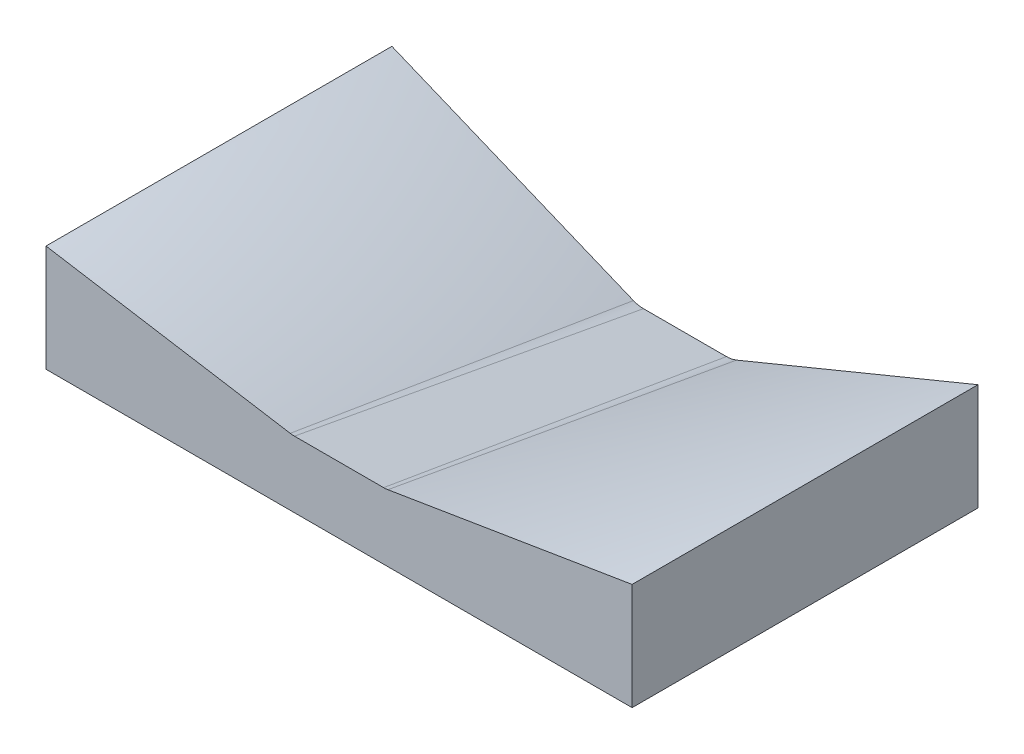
ISO-10303-21;
HEADER;
FILE_DESCRIPTION(('STEP AP214'),'2;1');
FILE_NAME('part.step','',(''),(''),'','','');
FILE_SCHEMA(('AUTOMOTIVE_DESIGN { 1 0 10303 214 1 1 1 1 }'));
ENDSEC;
DATA;
#1=APPLICATION_CONTEXT('core data for automotive mechanical design processes');
#2=APPLICATION_PROTOCOL_DEFINITION('international standard','automotive_design',2000,#1);
#3=PRODUCT_CONTEXT('',#1,'mechanical');
#4=PRODUCT('Part','Part','',(#3));
#5=PRODUCT_RELATED_PRODUCT_CATEGORY('part','',(#4));
#6=PRODUCT_DEFINITION_FORMATION('','',#4);
#7=PRODUCT_DEFINITION_CONTEXT('part definition',#1,'design');
#8=PRODUCT_DEFINITION('design','',#6,#7);
#9=PRODUCT_DEFINITION_SHAPE('','',#8);
#10=(LENGTH_UNIT() NAMED_UNIT(*) SI_UNIT(.MILLI.,.METRE.));
#11=(NAMED_UNIT(*) PLANE_ANGLE_UNIT() SI_UNIT($,.RADIAN.));
#12=(NAMED_UNIT(*) SI_UNIT($,.STERADIAN.) SOLID_ANGLE_UNIT());
#13=UNCERTAINTY_MEASURE_WITH_UNIT(LENGTH_MEASURE(1.E-05),#10,'distance_accuracy_value','');
#14=(GEOMETRIC_REPRESENTATION_CONTEXT(3) GLOBAL_UNCERTAINTY_ASSIGNED_CONTEXT((#13)) GLOBAL_UNIT_ASSIGNED_CONTEXT((#10,
#11,#12)) REPRESENTATION_CONTEXT('',''));
#15=CARTESIAN_POINT('',(0.,0.,0.));
#16=DIRECTION('',(0.,0.,1.));
#17=DIRECTION('',(1.,0.,0.));
#18=AXIS2_PLACEMENT_3D('',#15,#16,#17);
#19=CARTESIAN_POINT('',(17.5,24.8519766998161,0.));
#20=DIRECTION('',(0.,0.,-1.));
#21=DIRECTION('',(0.,1.,0.));
#22=AXIS2_PLACEMENT_3D('',#19,#20,#21);
#23=PLANE('',#22);
#24=DIRECTION('',(-0.986798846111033,-0.161950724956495,0.));
#25=VECTOR('',#24,1.);
#26=CARTESIAN_POINT('',(63.65,32.4259883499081,0.));
#27=LINE('',#26,#25);
#28=CARTESIAN_POINT('',(109.8,40.,0.));
#29=VERTEX_POINT('',#28);
#30=CARTESIAN_POINT('',(18.2930915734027,24.9821367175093,0.));
#31=VERTEX_POINT('',#30);
#32=EDGE_CURVE('E238',#29,#31,#27,.T.);
#33=ORIENTED_EDGE('',*,*,#32,.T.);
#34=CARTESIAN_POINT('',(19.5300489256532,-3.28344653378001,-165.084261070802));
#35=CARTESIAN_POINT('',(17.5014750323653,-4.22467563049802,-164.901889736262));
#36=CARTESIAN_POINT('',(15.2578252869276,-4.22157234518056,-164.88429013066));
#37=CARTESIAN_POINT('',(19.4954893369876,-2.28018789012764,-159.170011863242));
#38=CARTESIAN_POINT('',(17.501428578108,-3.18399226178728,-158.999881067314));
#39=CARTESIAN_POINT('',(15.3056121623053,-3.1799993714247,-158.977236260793));
#40=CARTESIAN_POINT('',(19.4598105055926,-1.27619849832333,-153.255865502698));
#41=CARTESIAN_POINT('',(17.5013818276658,-2.14239247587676,-153.092675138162));
#42=CARTESIAN_POINT('',(15.3538529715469,-2.13842703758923,-153.070186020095));
#43=CARTESIAN_POINT('',(19.3862143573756,0.733241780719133,-141.427778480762));
#44=CARTESIAN_POINT('',(17.5012878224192,-0.0592757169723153,-141.278732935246));
#45=CARTESIAN_POINT('',(15.4512424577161,-0.0552836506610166,-141.256092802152));
#46=CARTESIAN_POINT('',(19.3482970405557,1.73869266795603,-135.513837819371));
#47=CARTESIAN_POINT('',(17.5012405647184,0.982327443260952,-135.371507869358));
#48=CARTESIAN_POINT('',(15.5003911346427,0.986287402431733,-135.349049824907));
#49=CARTESIAN_POINT('',(19.3092604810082,2.7448743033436,-129.600000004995));
#50=CARTESIAN_POINT('',(17.5011930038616,2.02505651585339,-129.457897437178));
#51=CARTESIAN_POINT('',(15.5499937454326,2.02785781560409,-129.44201047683));
#52=CARTESIAN_POINT('',(19.277105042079,3.57416023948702,-124.726251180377));
#53=CARTESIAN_POINT('',(17.5011540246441,2.88280156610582,-124.593383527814));
#54=CARTESIAN_POINT('',(15.5908608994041,2.88624529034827,-124.573853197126));
#55=CARTESIAN_POINT('',(19.2441837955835,4.40402026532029,-119.852585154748));
#56=CARTESIAN_POINT('',(17.5011149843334,3.7412756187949,-119.724735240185));
#57=CARTESIAN_POINT('',(15.6320281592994,3.7446323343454,-119.705698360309));
#58=CARTESIAN_POINT('',(19.095169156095,8.08048504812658,-98.2782224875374));
#59=CARTESIAN_POINT('',(17.5009431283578,7.53472803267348,-98.2109975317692));
#60=CARTESIAN_POINT('',(15.8155322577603,7.54454484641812,-98.1553236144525));
#61=CARTESIAN_POINT('',(18.9711191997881,10.9339675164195,-81.5785438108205));
#62=CARTESIAN_POINT('',(17.5008115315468,10.4777959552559,-81.5200299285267));
#63=CARTESIAN_POINT('',(15.9609379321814,10.4860658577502,-81.473128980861));
#64=CARTESIAN_POINT('',(18.7076515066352,16.6612889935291,-48.1823756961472));
#65=CARTESIAN_POINT('',(17.50056598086,16.3612310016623,-48.1534117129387));
#66=CARTESIAN_POINT('',(16.2572955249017,16.3690991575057,-48.1087891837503));
#67=CARTESIAN_POINT('',(18.5682337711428,19.5351280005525,-31.48588625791));
#68=CARTESIAN_POINT('',(17.5004518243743,19.3047584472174,-31.4598380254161));
#69=CARTESIAN_POINT('',(16.4082474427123,19.31061144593,-31.4266440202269));
#70=CARTESIAN_POINT('',(18.3802538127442,23.273892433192,-9.86077718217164));
#71=CARTESIAN_POINT('',(17.5003246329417,23.1191037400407,-9.82761091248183));
#72=CARTESIAN_POINT('',(16.6063323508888,23.1208877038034,-9.81749355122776));
#73=CARTESIAN_POINT('',(18.3368958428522,24.1274415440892,-4.93029376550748));
#74=CARTESIAN_POINT('',(17.5002970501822,23.9879795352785,-4.89997141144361));
#75=CARTESIAN_POINT('',(16.6516686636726,23.9896544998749,-4.89047221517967));
#76=CARTESIAN_POINT('',(18.293091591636,24.9821367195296,-5.5612234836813E-09));
#77=CARTESIAN_POINT('',(17.500271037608,24.8571531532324,0.0293571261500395));
#78=CARTESIAN_POINT('',(16.6971559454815,24.8584210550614,0.0365477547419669));
#79=CARTESIAN_POINT('',(18.2663480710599,25.5040611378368,3.01074410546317));
#80=CARTESIAN_POINT('',(17.5002551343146,25.3876000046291,3.03767071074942));
#81=CARTESIAN_POINT('',(16.7249319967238,25.3889438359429,3.04529195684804));
#82=CARTESIAN_POINT('',(18.2394428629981,26.0264089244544,6.02141802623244));
#83=CARTESIAN_POINT('',(17.5002398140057,25.9181772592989,6.04672384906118));
#84=CARTESIAN_POINT('',(16.752763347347,25.9194665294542,6.0540356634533));
#85=CARTESIAN_POINT('',(18.1853404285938,27.0719696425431,12.0426214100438));
#86=CARTESIAN_POINT('',(17.500210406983,26.9793084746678,12.0646980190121));
#87=CARTESIAN_POINT('',(16.8085254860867,26.9805117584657,12.0715221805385));
#88=CARTESIAN_POINT('',(18.1581432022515,27.5951825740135,15.053150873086));
#89=CARTESIAN_POINT('',(17.5001963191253,27.5098859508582,15.073752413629));
#90=CARTESIAN_POINT('',(16.8364562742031,27.5110342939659,15.0802649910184));
#91=CARTESIAN_POINT('',(18.1034880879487,28.6424919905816,21.0740612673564));
#92=CARTESIAN_POINT('',(17.5001694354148,28.571017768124,21.0917299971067));
#93=CARTESIAN_POINT('',(16.8924061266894,28.572079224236,21.0977498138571));
#94=CARTESIAN_POINT('',(18.0760301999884,29.1665884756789,24.0844421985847));
#95=CARTESIAN_POINT('',(17.5001566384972,29.101596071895,24.1007890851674));
#96=CARTESIAN_POINT('',(16.9204251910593,29.1026016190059,24.1064918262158));
#97=CARTESIAN_POINT('',(18.0208868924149,30.2156803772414,30.1050519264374));
#98=CARTESIAN_POINT('',(17.5001323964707,30.1627285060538,30.1187701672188));
#99=CARTESIAN_POINT('',(16.9765400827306,30.163646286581,30.1239751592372));
#100=CARTESIAN_POINT('',(17.9932014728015,30.7406757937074,33.1152807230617));
#101=CARTESIAN_POINT('',(17.5001209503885,30.6933069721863,33.127830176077));
#102=CARTESIAN_POINT('',(17.004635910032,30.6941685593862,33.1327164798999));
#103=CARTESIAN_POINT('',(17.9654188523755,31.2661283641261,36.1254316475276));
#104=CARTESIAN_POINT('',(17.5001102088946,31.2239436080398,36.137220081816));
#105=CARTESIAN_POINT('',(17.0327643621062,31.2246907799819,36.1414575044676));
#106=(BOUNDED_SURFACE() B_SPLINE_SURFACE(3,2,((#34,#35,#36),(#37,#38,#39),(#40,#41,#42),(#43,
#44,#45),(#46,#47,#48),(#49,#50,#51),(#52,#53,#54),(#55,#56,#57),(#58,#59,#60),(#61,#62,#63),
(#64,#65,#66),(#67,#68,#69),(#70,#71,#72),(#73,#74,#75),(#76,#77,#78),(#79,#80,#81),(#82,#83,
#84),(#85,#86,#87),(#88,#89,#90),(#91,#92,#93),(#94,#95,#96),(#97,#98,#99),(#100,#101,#102),
(#103,#104,#105)),.UNSPECIFIED.,.F.,.F.,.F.) B_SPLINE_SURFACE_WITH_KNOTS((4,2,3,2,2,2,3,2,2,2,
4),(3,3),(0.,17.9951099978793,35.9902199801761,50.8204961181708,101.641000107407,
152.461499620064,167.471201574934,176.63705714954,185.802912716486,194.968768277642,
204.134623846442),(0.,1.),
.UNSPECIFIED.) GEOMETRIC_REPRESENTATION_ITEM() RATIONAL_B_SPLINE_SURFACE(((1.,0.975740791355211,
1.),(1.,0.976739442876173,1.),(1.,0.977717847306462,1.),(1.,0.979634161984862,1.),(1.,
0.980572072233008,1.),(1.,0.981489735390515,1.),(1.,0.982244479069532,1.),(1.,0.982983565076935,
1.),(1.,0.986179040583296,1.),(1.,0.988450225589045,1.),(1.,0.992460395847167,1.),(1.,
0.994199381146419,1.),(1.,0.996037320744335,1.),(1.,0.99642845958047,1.),(1.,0.996790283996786,
1.),(1.,0.997011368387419,1.),(1.,0.997221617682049,1.),(1.,0.997620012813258,1.),(1.,
0.997808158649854,1.),(1.,0.998161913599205,1.),(1.,0.998327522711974,1.),(1.,0.998635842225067,
1.),(1.,0.998778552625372,1.),(1.,0.998909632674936,1.))) REPRESENTATION_ITEM('') SURFACE());
#107=CARTESIAN_POINT('',(18.2930915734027,24.9821367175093,0.));
#108=CARTESIAN_POINT('',(18.0288115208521,24.9387919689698,0.));
#109=CARTESIAN_POINT('',(17.7636487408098,24.9062729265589,0.));
#110=CARTESIAN_POINT('',(17.2315577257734,24.862886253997,0.));
#111=CARTESIAN_POINT('',(16.9646294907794,24.8520186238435,0.));
#112=CARTESIAN_POINT('',(16.6968185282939,24.8519766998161,0.));
#113=B_SPLINE_CURVE_WITH_KNOTS('',3,(#107,#108,#109,#110,#111,#112),.UNSPECIFIED.,.F.,.F.,(4,2,
4),(0.,0.801448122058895,1.60289624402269),.UNSPECIFIED.);
#114=CARTESIAN_POINT('',(16.6968185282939,24.8519766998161,0.));
#115=VERTEX_POINT('',#114);
#116=EDGE_CURVE('E344',#31,#115,#113,.T.);
#117=ORIENTED_EDGE('',*,*,#116,.T.);
#118=DIRECTION('',(-1.,0.,0.));
#119=VECTOR('',#118,1.);
#120=CARTESIAN_POINT('',(17.5,24.8519766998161,0.));
#121=LINE('',#120,#119);
#122=CARTESIAN_POINT('',(-16.696818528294,24.8519766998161,0.));
#123=VERTEX_POINT('',#122);
#124=EDGE_CURVE('E251',#115,#123,#121,.T.);
#125=ORIENTED_EDGE('',*,*,#124,.T.);
#126=CARTESIAN_POINT('',(-15.2578252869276,-4.22157234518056,-164.88429013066));
#127=CARTESIAN_POINT('',(-17.5014750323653,-4.22467563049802,-164.901889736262));
#128=CARTESIAN_POINT('',(-19.5300489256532,-3.28344653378,-165.084261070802));
#129=CARTESIAN_POINT('',(-15.3056121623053,-3.1799993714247,-158.977236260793));
#130=CARTESIAN_POINT('',(-17.501428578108,-3.18399226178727,-158.999881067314));
#131=CARTESIAN_POINT('',(-19.4954893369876,-2.28018789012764,-159.170011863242));
#132=CARTESIAN_POINT('',(-15.3538529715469,-2.13842703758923,-153.070186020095));
#133=CARTESIAN_POINT('',(-17.5013818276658,-2.14239247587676,-153.092675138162));
#134=CARTESIAN_POINT('',(-19.4598105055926,-1.27619849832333,-153.255865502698));
#135=CARTESIAN_POINT('',(-15.4512424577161,-0.0552836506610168,-141.256092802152));
#136=CARTESIAN_POINT('',(-17.5012878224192,-0.0592757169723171,-141.278732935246));
#137=CARTESIAN_POINT('',(-19.3862143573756,0.733241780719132,-141.427778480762));
#138=CARTESIAN_POINT('',(-15.5003911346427,0.986287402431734,-135.349049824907));
#139=CARTESIAN_POINT('',(-17.5012405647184,0.98232744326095,-135.371507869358));
#140=CARTESIAN_POINT('',(-19.3482970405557,1.73869266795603,-135.513837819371));
#141=CARTESIAN_POINT('',(-15.5499937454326,2.02785781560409,-129.44201047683));
#142=CARTESIAN_POINT('',(-17.5011930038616,2.02505651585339,-129.457897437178));
#143=CARTESIAN_POINT('',(-19.3092604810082,2.7448743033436,-129.600000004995));
#144=CARTESIAN_POINT('',(-15.5908608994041,2.88624529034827,-124.573853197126));
#145=CARTESIAN_POINT('',(-17.5011540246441,2.88280156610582,-124.593383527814));
#146=CARTESIAN_POINT('',(-19.277105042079,3.57416023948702,-124.726251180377));
#147=CARTESIAN_POINT('',(-15.6320281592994,3.7446323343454,-119.705698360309));
#148=CARTESIAN_POINT('',(-17.5011149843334,3.7412756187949,-119.724735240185));
#149=CARTESIAN_POINT('',(-19.2441837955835,4.40402026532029,-119.852585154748));
#150=CARTESIAN_POINT('',(-15.8155322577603,7.54454484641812,-98.1553236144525));
#151=CARTESIAN_POINT('',(-17.5009431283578,7.53472803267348,-98.2109975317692));
#152=CARTESIAN_POINT('',(-19.095169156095,8.08048504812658,-98.2782224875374));
#153=CARTESIAN_POINT('',(-15.9609379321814,10.4860658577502,-81.473128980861));
#154=CARTESIAN_POINT('',(-17.5008115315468,10.4777959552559,-81.5200299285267));
#155=CARTESIAN_POINT('',(-18.9711191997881,10.9339675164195,-81.5785438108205));
#156=CARTESIAN_POINT('',(-16.2572955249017,16.3690991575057,-48.1087891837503));
#157=CARTESIAN_POINT('',(-17.50056598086,16.3612310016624,-48.1534117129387));
#158=CARTESIAN_POINT('',(-18.7076515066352,16.6612889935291,-48.1823756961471));
#159=CARTESIAN_POINT('',(-16.4082474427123,19.31061144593,-31.4266440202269));
#160=CARTESIAN_POINT('',(-17.5004518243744,19.3047584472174,-31.4598380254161));
#161=CARTESIAN_POINT('',(-18.5682337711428,19.5351280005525,-31.48588625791));
#162=CARTESIAN_POINT('',(-16.6063323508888,23.1208877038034,-9.81749355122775));
#163=CARTESIAN_POINT('',(-17.5003246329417,23.1191037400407,-9.82761091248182));
#164=CARTESIAN_POINT('',(-18.3802538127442,23.273892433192,-9.86077718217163));
#165=CARTESIAN_POINT('',(-16.6516686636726,23.9896544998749,-4.89047221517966));
#166=CARTESIAN_POINT('',(-17.5002970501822,23.9879795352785,-4.8999714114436));
#167=CARTESIAN_POINT('',(-18.3368958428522,24.1274415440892,-4.93029376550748));
#168=CARTESIAN_POINT('',(-16.6971559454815,24.8584210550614,0.0365477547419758));
#169=CARTESIAN_POINT('',(-17.500271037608,24.8571531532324,0.029357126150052));
#170=CARTESIAN_POINT('',(-18.293091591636,24.9821367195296,-5.5612090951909E-09));
#171=CARTESIAN_POINT('',(-16.7249319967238,25.3889438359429,3.04529195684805));
#172=CARTESIAN_POINT('',(-17.5002551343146,25.3876000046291,3.03767071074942));
#173=CARTESIAN_POINT('',(-18.2663480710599,25.5040611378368,3.01074410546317));
#174=CARTESIAN_POINT('',(-16.752763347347,25.9194665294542,6.05403566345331));
#175=CARTESIAN_POINT('',(-17.5002398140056,25.9181772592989,6.04672384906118));
#176=CARTESIAN_POINT('',(-18.2394428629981,26.0264089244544,6.02141802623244));
#177=CARTESIAN_POINT('',(-16.8085254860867,26.9805117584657,12.0715221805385));
#178=CARTESIAN_POINT('',(-17.500210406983,26.9793084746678,12.0646980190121));
#179=CARTESIAN_POINT('',(-18.1853404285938,27.0719696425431,12.0426214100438));
#180=CARTESIAN_POINT('',(-16.8364562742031,27.5110342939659,15.0802649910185));
#181=CARTESIAN_POINT('',(-17.5001963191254,27.5098859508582,15.073752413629));
#182=CARTESIAN_POINT('',(-18.1581432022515,27.5951825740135,15.053150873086));
#183=CARTESIAN_POINT('',(-16.8924061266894,28.572079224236,21.0977498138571));
#184=CARTESIAN_POINT('',(-17.5001694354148,28.571017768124,21.0917299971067));
#185=CARTESIAN_POINT('',(-18.1034880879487,28.6424919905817,21.0740612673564));
#186=CARTESIAN_POINT('',(-16.9204251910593,29.1026016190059,24.1064918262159));
#187=CARTESIAN_POINT('',(-17.5001566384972,29.101596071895,24.1007890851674));
#188=CARTESIAN_POINT('',(-18.0760301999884,29.1665884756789,24.0844421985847));
#189=CARTESIAN_POINT('',(-16.9765400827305,30.163646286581,30.1239751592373));
#190=CARTESIAN_POINT('',(-17.5001323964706,30.1627285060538,30.1187701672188));
#191=CARTESIAN_POINT('',(-18.0208868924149,30.2156803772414,30.1050519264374));
#192=CARTESIAN_POINT('',(-17.004635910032,30.6941685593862,33.1327164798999));
#193=CARTESIAN_POINT('',(-17.5001209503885,30.6933069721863,33.127830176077));
#194=CARTESIAN_POINT('',(-17.9932014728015,30.7406757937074,33.1152807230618));
#195=CARTESIAN_POINT('',(-17.0327643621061,31.2246907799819,36.1414575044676));
#196=CARTESIAN_POINT('',(-17.5001102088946,31.2239436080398,36.1372200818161));
#197=CARTESIAN_POINT('',(-17.9654188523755,31.2661283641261,36.1254316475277));
#198=(BOUNDED_SURFACE() B_SPLINE_SURFACE(3,2,((#126,#127,#128),(#129,#130,#131),(#132,#133,
#134),(#135,#136,#137),(#138,#139,#140),(#141,#142,#143),(#144,#145,#146),(#147,#148,#149),
(#150,#151,#152),(#153,#154,#155),(#156,#157,#158),(#159,#160,#161),(#162,#163,#164),(#165,#166,
#167),(#168,#169,#170),(#171,#172,#173),(#174,#175,#176),(#177,#178,#179),(#180,#181,#182),
(#183,#184,#185),(#186,#187,#188),(#189,#190,#191),(#192,#193,#194),(#195,#196,#197)),
.UNSPECIFIED.,.F.,.F.,.F.) B_SPLINE_SURFACE_WITH_KNOTS((4,2,3,2,2,2,3,2,2,2,4),(3,3),(0.,
17.9951099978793,35.9902199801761,50.8204961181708,101.641000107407,152.461499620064,
167.471201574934,176.63705714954,185.802912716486,194.968768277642,204.134623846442),(0.,1.),
.UNSPECIFIED.) GEOMETRIC_REPRESENTATION_ITEM() RATIONAL_B_SPLINE_SURFACE(((1.,0.975740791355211,
1.),(1.,0.976739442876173,1.),(1.,0.977717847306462,1.),(1.,0.979634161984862,1.),(1.,
0.980572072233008,1.),(1.,0.981489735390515,1.),(1.,0.982244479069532,1.),(1.,0.982983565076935,
1.),(1.,0.986179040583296,1.),(1.,0.988450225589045,1.),(1.,0.992460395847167,1.),(1.,
0.994199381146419,1.),(1.,0.996037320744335,1.),(1.,0.99642845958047,1.),(1.,0.996790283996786,
1.),(1.,0.997011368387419,1.),(1.,0.997221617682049,1.),(1.,0.997620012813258,1.),(1.,
0.997808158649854,1.),(1.,0.998161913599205,1.),(1.,0.998327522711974,1.),(1.,0.998635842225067,
1.),(1.,0.998778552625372,1.),(1.,0.998909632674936,1.))) REPRESENTATION_ITEM('') SURFACE());
#199=CARTESIAN_POINT('',(-16.696818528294,24.8519766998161,0.));
#200=CARTESIAN_POINT('',(-16.964629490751,24.8520186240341,0.));
#201=CARTESIAN_POINT('',(-17.2315577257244,24.8628862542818,0.));
#202=CARTESIAN_POINT('',(-17.763648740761,24.9062729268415,0.));
#203=CARTESIAN_POINT('',(-18.0288115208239,24.9387919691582,0.));
#204=CARTESIAN_POINT('',(-18.2930915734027,24.9821367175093,0.));
#205=B_SPLINE_CURVE_WITH_KNOTS('',3,(#199,#200,#201,#202,#203,#204),.UNSPECIFIED.,.F.,.F.,(4,2,
4),(0.,0.80144812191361,1.60289624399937),.UNSPECIFIED.);
#206=CARTESIAN_POINT('',(-18.2930915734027,24.9821367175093,0.));
#207=VERTEX_POINT('',#206);
#208=EDGE_CURVE('E156',#123,#207,#205,.T.);
#209=ORIENTED_EDGE('',*,*,#208,.T.);
#210=DIRECTION('',(0.986798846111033,-0.161950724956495,0.));
#211=VECTOR('',#210,1.);
#212=CARTESIAN_POINT('',(-63.65,32.4259883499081,0.));
#213=LINE('',#212,#211);
#214=CARTESIAN_POINT('',(-109.8,40.,0.));
#215=VERTEX_POINT('',#214);
#216=EDGE_CURVE('E252',#215,#207,#213,.T.);
#217=ORIENTED_EDGE('',*,*,#216,.F.);
#218=DIRECTION('',(0.,-1.,0.));
#219=VECTOR('',#218,1.);
#220=CARTESIAN_POINT('',(-109.8,20.,0.));
#221=LINE('',#220,#219);
#222=CARTESIAN_POINT('',(-109.8,0.,0.));
#223=VERTEX_POINT('',#222);
#224=EDGE_CURVE('E254',#215,#223,#221,.T.);
#225=ORIENTED_EDGE('',*,*,#224,.T.);
#226=DIRECTION('',(-1.,0.,0.));
#227=VECTOR('',#226,1.);
#228=CARTESIAN_POINT('',(17.5,0.,0.));
#229=LINE('',#228,#227);
#230=CARTESIAN_POINT('',(109.8,0.,0.));
#231=VERTEX_POINT('',#230);
#232=EDGE_CURVE('E267',#231,#223,#229,.T.);
#233=ORIENTED_EDGE('',*,*,#232,.F.);
#234=DIRECTION('',(0.,-1.,0.));
#235=VECTOR('',#234,1.);
#236=CARTESIAN_POINT('',(109.8,20.,0.));
#237=LINE('',#236,#235);
#238=EDGE_CURVE('E243',#29,#231,#237,.T.);
#239=ORIENTED_EDGE('',*,*,#238,.F.);
#240=EDGE_LOOP('',(#33,#117,#125,#209,#217,#225,#233,#239));
#241=FACE_BOUND('',#240,.T.);
#242=ADVANCED_FACE('F143',(#241),#23,.F.);
#243=CARTESIAN_POINT('',(17.5,0.,0.));
#244=DIRECTION('',(0.,1.,0.));
#245=DIRECTION('',(0.,0.,1.));
#246=AXIS2_PLACEMENT_3D('',#243,#244,#245);
#247=PLANE('',#246);
#248=ORIENTED_EDGE('',*,*,#232,.T.);
#249=DIRECTION('',(0.,0.,-1.));
#250=VECTOR('',#249,1.);
#251=CARTESIAN_POINT('',(-109.8,0.,-64.8));
#252=LINE('',#251,#250);
#253=CARTESIAN_POINT('',(-109.8,0.,-129.6));
#254=VERTEX_POINT('',#253);
#255=EDGE_CURVE('E257',#223,#254,#252,.T.);
#256=ORIENTED_EDGE('',*,*,#255,.T.);
#257=DIRECTION('',(-1.,0.,0.));
#258=VECTOR('',#257,1.);
#259=CARTESIAN_POINT('',(17.5,0.,-129.6));
#260=LINE('',#259,#258);
#261=CARTESIAN_POINT('',(109.8,0.,-129.6));
#262=VERTEX_POINT('',#261);
#263=EDGE_CURVE('E265',#262,#254,#260,.T.);
#264=ORIENTED_EDGE('',*,*,#263,.F.);
#265=DIRECTION('',(0.,0.,-1.));
#266=VECTOR('',#265,1.);
#267=CARTESIAN_POINT('',(109.8,0.,-64.8));
#268=LINE('',#267,#266);
#269=EDGE_CURVE('E222',#231,#262,#268,.T.);
#270=ORIENTED_EDGE('',*,*,#269,.F.);
#271=EDGE_LOOP('',(#248,#256,#264,#270));
#272=FACE_BOUND('',#271,.T.);
#273=ADVANCED_FACE('F361',(#272),#247,.F.);
#274=CARTESIAN_POINT('',(17.5,0.,-129.6));
#275=DIRECTION('',(0.,0.,1.));
#276=DIRECTION('',(1.,0.,0.));
#277=AXIS2_PLACEMENT_3D('',#274,#275,#276);
#278=PLANE('',#277);
#279=ORIENTED_EDGE('',*,*,#263,.T.);
#280=DIRECTION('',(0.,1.,0.));
#281=VECTOR('',#280,1.);
#282=CARTESIAN_POINT('',(-109.8,20.,-129.6));
#283=LINE('',#282,#281);
#284=CARTESIAN_POINT('',(-109.8,40.,-129.6));
#285=VERTEX_POINT('',#284);
#286=EDGE_CURVE('E241',#254,#285,#283,.T.);
#287=ORIENTED_EDGE('',*,*,#286,.T.);
#288=DIRECTION('',(0.924698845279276,-0.38069941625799,0.));
#289=VECTOR('',#288,1.);
#290=CARTESIAN_POINT('',(-63.65,21.,-129.6));
#291=LINE('',#290,#289);
#292=CARTESIAN_POINT('',(-19.3092604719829,2.74487430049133,-129.6));
#293=VERTEX_POINT('',#292);
#294=EDGE_CURVE('E239',#285,#293,#291,.T.);
#295=ORIENTED_EDGE('',*,*,#294,.T.);
#296=CARTESIAN_POINT('',(-19.3092604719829,2.74487430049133,-129.6));
#297=CARTESIAN_POINT('',(-19.049875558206,2.63804738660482,-129.6));
#298=CARTESIAN_POINT('',(-18.7859302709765,2.54227367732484,-129.6));
#299=CARTESIAN_POINT('',(-18.2507499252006,2.3734126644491,-129.6));
#300=CARTESIAN_POINT('',(-17.979511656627,2.30033553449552,-129.6));
#301=CARTESIAN_POINT('',(-17.4362494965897,2.17853927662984,-129.6));
#302=CARTESIAN_POINT('',(-17.1643095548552,2.1294446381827,-129.6));
#303=CARTESIAN_POINT('',(-16.6173679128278,2.05425920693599,-129.6));
#304=CARTESIAN_POINT('',(-16.3423679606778,2.02815590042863,-129.6));
#305=CARTESIAN_POINT('',(-15.9805452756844,2.00909292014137,-129.6));
#306=CARTESIAN_POINT('',(-15.8941892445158,2.00568284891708,-129.6));
#307=CARTESIAN_POINT('',(-15.7214476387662,2.0011371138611,-129.6));
#308=CARTESIAN_POINT('',(-15.6350620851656,2.00000065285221,-129.6));
#309=CARTESIAN_POINT('',(-15.5486674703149,2.,-129.6));
#310=B_SPLINE_CURVE_WITH_KNOTS('',3,(#296,#297,#298,#299,#300,#301,#302,#303,#304,#305,#306,
#307,#308,#309),.UNSPECIFIED.,.F.,.F.,(4,2,2,2,2,2,4),(0.,0.841330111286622,1.683036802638,
2.51110442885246,3.3387210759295,3.5979702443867,3.85712849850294),.UNSPECIFIED.);
#311=CARTESIAN_POINT('',(-15.5486674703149,2.,-129.6));
#312=VERTEX_POINT('',#311);
#313=EDGE_CURVE('E12',#293,#312,#310,.T.);
#314=ORIENTED_EDGE('',*,*,#313,.T.);
#315=DIRECTION('',(-1.,0.,0.));
#316=VECTOR('',#315,1.);
#317=CARTESIAN_POINT('',(17.5,2.,-129.6));
#318=LINE('',#317,#316);
#319=CARTESIAN_POINT('',(15.5486674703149,2.,-129.6));
#320=VERTEX_POINT('',#319);
#321=EDGE_CURVE('E262',#320,#312,#318,.T.);
#322=ORIENTED_EDGE('',*,*,#321,.F.);
#323=CARTESIAN_POINT('',(15.5486674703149,2.,-129.6));
#324=CARTESIAN_POINT('',(15.8280276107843,1.99996482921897,-129.6));
#325=CARTESIAN_POINT('',(16.1073886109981,2.0118841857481,-129.6));
#326=CARTESIAN_POINT('',(16.6641922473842,2.05938590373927,-129.6));
#327=CARTESIAN_POINT('',(16.9416341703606,2.09497663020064,-129.6));
#328=CARTESIAN_POINT('',(17.4880549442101,2.18881492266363,-129.6));
#329=CARTESIAN_POINT('',(17.757098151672,2.24668935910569,-129.6));
#330=CARTESIAN_POINT('',(18.2893367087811,2.38463964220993,-129.6));
#331=CARTESIAN_POINT('',(18.5525349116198,2.46470438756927,-129.6));
#332=CARTESIAN_POINT('',(18.8956151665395,2.58486405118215,-129.6));
#333=CARTESIAN_POINT('',(18.9789594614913,2.61531803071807,-129.6));
#334=CARTESIAN_POINT('',(19.1447703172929,2.67843939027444,-129.6));
#335=CARTESIAN_POINT('',(19.2272371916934,2.7111059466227,-129.6));
#336=CARTESIAN_POINT('',(19.3092604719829,2.74487430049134,-129.6));
#337=B_SPLINE_CURVE_WITH_KNOTS('',3,(#323,#324,#325,#326,#327,#328,#329,#330,#331,#332,#333,
#334,#335,#336),.UNSPECIFIED.,.F.,.F.,(4,2,2,2,2,2,4),(0.,0.837831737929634,1.67595970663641,
2.5006244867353,3.32487744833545,3.59105675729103,3.85713751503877),.UNSPECIFIED.);
#338=CARTESIAN_POINT('',(19.3092604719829,2.74487430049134,-129.6));
#339=VERTEX_POINT('',#338);
#340=EDGE_CURVE('E230',#320,#339,#337,.T.);
#341=ORIENTED_EDGE('',*,*,#340,.T.);
#342=DIRECTION('',(-0.924698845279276,-0.38069941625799,0.));
#343=VECTOR('',#342,1.);
#344=CARTESIAN_POINT('',(63.65,21.,-129.6));
#345=LINE('',#344,#343);
#346=CARTESIAN_POINT('',(109.8,40.,-129.6));
#347=VERTEX_POINT('',#346);
#348=EDGE_CURVE('E224',#347,#339,#345,.T.);
#349=ORIENTED_EDGE('',*,*,#348,.F.);
#350=DIRECTION('',(0.,1.,0.));
#351=VECTOR('',#350,1.);
#352=CARTESIAN_POINT('',(109.8,20.,-129.6));
#353=LINE('',#352,#351);
#354=EDGE_CURVE('E215',#262,#347,#353,.T.);
#355=ORIENTED_EDGE('',*,*,#354,.F.);
#356=EDGE_LOOP('',(#279,#287,#295,#314,#322,#341,#349,#355));
#357=FACE_BOUND('',#356,.T.);
#358=ADVANCED_FACE('F227',(#357),#278,.F.);
#359=CARTESIAN_POINT('',(17.5,2.,-129.6));
#360=DIRECTION('',(0.,-0.984807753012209,0.173648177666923));
#361=DIRECTION('',(0.,-0.173648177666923,-0.984807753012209));
#362=AXIS2_PLACEMENT_3D('',#359,#360,#361);
#363=PLANE('',#362);
#364=ORIENTED_EDGE('',*,*,#124,.F.);
#365=CARTESIAN_POINT('',(17.0327643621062,31.2246907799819,36.1414575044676));
#366=CARTESIAN_POINT('',(17.004635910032,30.6941685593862,33.1327164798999));
#367=CARTESIAN_POINT('',(16.9765400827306,30.163646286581,30.1239751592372));
#368=CARTESIAN_POINT('',(16.9204251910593,29.1026016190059,24.1064918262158));
#369=CARTESIAN_POINT('',(16.8924061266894,28.572079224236,21.0977498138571));
#370=CARTESIAN_POINT('',(16.8364562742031,27.5110342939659,15.0802649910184));
#371=CARTESIAN_POINT('',(16.8085254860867,26.9805117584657,12.0715221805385));
#372=CARTESIAN_POINT('',(16.752763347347,25.9194665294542,6.05403566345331));
#373=CARTESIAN_POINT('',(16.7249319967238,25.3889438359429,3.04529195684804));
#374=CARTESIAN_POINT('',(16.6971559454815,24.8584210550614,0.0365477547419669));
#375=CARTESIAN_POINT('',(16.6516686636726,23.9896544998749,-4.89047221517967));
#376=CARTESIAN_POINT('',(16.6063323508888,23.1208877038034,-9.81749355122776));
#377=CARTESIAN_POINT('',(16.4082474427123,19.31061144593,-31.4266440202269));
#378=CARTESIAN_POINT('',(16.2572955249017,16.3690991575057,-48.1087891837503));
#379=CARTESIAN_POINT('',(15.9609379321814,10.4860658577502,-81.473128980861));
#380=CARTESIAN_POINT('',(15.8155322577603,7.54454484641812,-98.1553236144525));
#381=CARTESIAN_POINT('',(15.6320281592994,3.7446323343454,-119.705698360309));
#382=CARTESIAN_POINT('',(15.5908608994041,2.88624529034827,-124.573853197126));
#383=CARTESIAN_POINT('',(15.5499937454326,2.02785781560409,-129.44201047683));
#384=CARTESIAN_POINT('',(15.5003911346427,0.986287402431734,-135.349049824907));
#385=CARTESIAN_POINT('',(15.4512424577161,-0.055283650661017,-141.256092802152));
#386=CARTESIAN_POINT('',(15.3538529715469,-2.13842703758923,-153.070186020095));
#387=CARTESIAN_POINT('',(15.3056121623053,-3.1799993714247,-158.977236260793));
#388=CARTESIAN_POINT('',(15.2578252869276,-4.22157234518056,-164.88429013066));
#389=B_SPLINE_CURVE_WITH_KNOTS('',3,(#365,#366,#367,#368,#369,#370,#371,#372,#373,#374,#375,
#376,#377,#378,#379,#380,#381,#382,#383,#384,#385,#386,#387,#388),.UNSPECIFIED.,.F.,.F.,(4,2,2,
2,3,2,2,2,3,2,4),(0.,9.16585556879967,18.3317111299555,27.497566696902,36.6634222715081,
51.6731242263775,102.493623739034,153.314127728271,168.144403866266,186.139513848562,
204.134623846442),.UNSPECIFIED.);
#390=EDGE_CURVE('E345',#115,#320,#389,.T.);
#391=ORIENTED_EDGE('',*,*,#390,.T.);
#392=ORIENTED_EDGE('',*,*,#321,.T.);
#393=CARTESIAN_POINT('',(-15.2578252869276,-4.22157234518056,-164.88429013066));
#394=CARTESIAN_POINT('',(-15.3056121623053,-3.1799993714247,-158.977236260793));
#395=CARTESIAN_POINT('',(-15.3538529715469,-2.13842703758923,-153.070186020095));
#396=CARTESIAN_POINT('',(-15.4512424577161,-0.055283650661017,-141.256092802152));
#397=CARTESIAN_POINT('',(-15.5003911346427,0.986287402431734,-135.349049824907));
#398=CARTESIAN_POINT('',(-15.5499937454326,2.02785781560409,-129.44201047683));
#399=CARTESIAN_POINT('',(-15.5908608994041,2.88624529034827,-124.573853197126));
#400=CARTESIAN_POINT('',(-15.6320281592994,3.7446323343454,-119.705698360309));
#401=CARTESIAN_POINT('',(-15.8155322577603,7.54454484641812,-98.1553236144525));
#402=CARTESIAN_POINT('',(-15.9609379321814,10.4860658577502,-81.473128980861));
#403=CARTESIAN_POINT('',(-16.2572955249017,16.3690991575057,-48.1087891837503));
#404=CARTESIAN_POINT('',(-16.4082474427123,19.31061144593,-31.4266440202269));
#405=CARTESIAN_POINT('',(-16.6063323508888,23.1208877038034,-9.81749355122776));
#406=CARTESIAN_POINT('',(-16.6516686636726,23.9896544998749,-4.89047221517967));
#407=CARTESIAN_POINT('',(-16.6971559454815,24.8584210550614,0.0365477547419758));
#408=CARTESIAN_POINT('',(-16.7249319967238,25.3889438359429,3.04529195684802));
#409=CARTESIAN_POINT('',(-16.752763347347,25.9194665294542,6.0540356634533));
#410=CARTESIAN_POINT('',(-16.8085254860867,26.9805117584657,12.0715221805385));
#411=CARTESIAN_POINT('',(-16.8364562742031,27.5110342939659,15.0802649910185));
#412=CARTESIAN_POINT('',(-16.8924061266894,28.572079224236,21.0977498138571));
#413=CARTESIAN_POINT('',(-16.9204251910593,29.1026016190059,24.1064918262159));
#414=CARTESIAN_POINT('',(-16.9765400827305,30.163646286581,30.1239751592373));
#415=CARTESIAN_POINT('',(-17.004635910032,30.6941685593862,33.1327164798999));
#416=CARTESIAN_POINT('',(-17.0327643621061,31.2246907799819,36.1414575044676));
#417=B_SPLINE_CURVE_WITH_KNOTS('',3,(#393,#394,#395,#396,#397,#398,#399,#400,#401,#402,#403,
#404,#405,#406,#407,#408,#409,#410,#411,#412,#413,#414,#415,#416),.UNSPECIFIED.,.F.,.F.,(4,2,3,
2,2,2,3,2,2,2,4),(0.,17.9951099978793,35.9902199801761,50.8204961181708,101.641000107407,
152.461499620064,167.471201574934,176.63705714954,185.802912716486,194.968768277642,
204.134623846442),.UNSPECIFIED.);
#418=EDGE_CURVE('E276',#312,#123,#417,.T.);
#419=ORIENTED_EDGE('',*,*,#418,.T.);
#420=EDGE_LOOP('',(#364,#391,#392,#419));
#421=FACE_BOUND('',#420,.T.);
#422=ADVANCED_FACE('F307',(#421),#363,.F.);
#423=CARTESIAN_POINT('',(-109.8,40.,-129.6));
#424=CARTESIAN_POINT('',(-17.5,2.00000000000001,-129.6));
#425=CARTESIAN_POINT('',(-109.8,40.,0.));
#426=CARTESIAN_POINT('',(-17.5,24.8519766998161,0.));
#427=B_SPLINE_SURFACE_WITH_KNOTS('',1,1,((#423,#424),(#425,#426)),.UNSPECIFIED.,.F.,.F.,.F.,(2,
2),(2,2),(0.,1.),(0.,1.),.UNSPECIFIED.);
#428=CARTESIAN_POINT('',(-17.9654188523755,31.2661283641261,36.1254316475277));
#429=CARTESIAN_POINT('',(-17.9932014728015,30.7406757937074,33.1152807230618));
#430=CARTESIAN_POINT('',(-18.0208868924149,30.2156803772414,30.1050519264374));
#431=CARTESIAN_POINT('',(-18.0760301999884,29.1665884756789,24.0844421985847));
#432=CARTESIAN_POINT('',(-18.1034880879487,28.6424919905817,21.0740612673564));
#433=CARTESIAN_POINT('',(-18.1581432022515,27.5951825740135,15.053150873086));
#434=CARTESIAN_POINT('',(-18.1853404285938,27.0719696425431,12.0426214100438));
#435=CARTESIAN_POINT('',(-18.2394428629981,26.0264089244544,6.02141802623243));
#436=CARTESIAN_POINT('',(-18.2663480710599,25.5040611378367,3.01074410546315));
#437=CARTESIAN_POINT('',(-18.293091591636,24.9821367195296,-5.5612090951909E-09));
#438=CARTESIAN_POINT('',(-18.3368958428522,24.1274415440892,-4.93029376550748));
#439=CARTESIAN_POINT('',(-18.3802538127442,23.273892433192,-9.86077718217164));
#440=CARTESIAN_POINT('',(-18.5682337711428,19.5351280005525,-31.48588625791));
#441=CARTESIAN_POINT('',(-18.7076515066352,16.6612889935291,-48.1823756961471));
#442=CARTESIAN_POINT('',(-18.9711191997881,10.9339675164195,-81.5785438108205));
#443=CARTESIAN_POINT('',(-19.095169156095,8.08048504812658,-98.2782224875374));
#444=CARTESIAN_POINT('',(-19.2441837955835,4.40402026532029,-119.852585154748));
#445=CARTESIAN_POINT('',(-19.277105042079,3.57416023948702,-124.726251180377));
#446=CARTESIAN_POINT('',(-19.3092604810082,2.7448743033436,-129.600000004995));
#447=CARTESIAN_POINT('',(-19.3482970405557,1.73869266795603,-135.513837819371));
#448=CARTESIAN_POINT('',(-19.3862143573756,0.733241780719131,-141.427778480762));
#449=CARTESIAN_POINT('',(-19.4598105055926,-1.27619849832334,-153.255865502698));
#450=CARTESIAN_POINT('',(-19.4954893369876,-2.28018789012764,-159.170011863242));
#451=CARTESIAN_POINT('',(-19.5300489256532,-3.28344653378,-165.084261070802));
#452=B_SPLINE_CURVE_WITH_KNOTS('',3,(#428,#429,#430,#431,#432,#433,#434,#435,#436,#437,#438,
#439,#440,#441,#442,#443,#444,#445,#446,#447,#448,#449,#450,#451),.UNSPECIFIED.,.F.,.F.,(4,2,2,
2,3,2,2,2,3,2,4),(0.,9.1658555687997,18.3317111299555,27.497566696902,36.6634222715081,
51.6731242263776,102.493623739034,153.314127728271,168.144403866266,186.139513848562,
204.134623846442),.UNSPECIFIED.);
#453=EDGE_CURVE('E164',#207,#293,#452,.T.);
#454=DIRECTION('',(0.,0.,1.));
#455=VECTOR('',#454,1.);
#456=CARTESIAN_POINT('',(-109.8,40.,-64.8));
#457=LINE('',#456,#455);
#458=EDGE_CURVE('E248',#285,#215,#457,.T.);
#459=ORIENTED_EDGE('',*,*,#216,.T.);
#460=ORIENTED_EDGE('',*,*,#453,.T.);
#461=ORIENTED_EDGE('',*,*,#294,.F.);
#462=ORIENTED_EDGE('',*,*,#458,.T.);
#463=EDGE_LOOP('',(#459,#460,#461,#462));
#464=FACE_BOUND('',#463,.T.);
#465=ADVANCED_FACE('F326',(#464),#427,.T.);
#466=CARTESIAN_POINT('',(-109.8,0.,0.));
#467=DIRECTION('',(1.,0.,0.));
#468=DIRECTION('',(0.,0.,-1.));
#469=AXIS2_PLACEMENT_3D('',#466,#467,#468);
#470=PLANE('',#469);
#471=ORIENTED_EDGE('',*,*,#286,.F.);
#472=ORIENTED_EDGE('',*,*,#255,.F.);
#473=ORIENTED_EDGE('',*,*,#224,.F.);
#474=ORIENTED_EDGE('',*,*,#458,.F.);
#475=EDGE_LOOP('',(#471,#472,#473,#474));
#476=FACE_BOUND('',#475,.T.);
#477=ADVANCED_FACE('F331',(#476),#470,.F.);
#478=CARTESIAN_POINT('',(109.8,40.,-129.6));
#479=CARTESIAN_POINT('',(17.5,2.00000000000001,-129.6));
#480=CARTESIAN_POINT('',(109.8,40.,0.));
#481=CARTESIAN_POINT('',(17.5,24.8519766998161,0.));
#482=B_SPLINE_SURFACE_WITH_KNOTS('',1,1,((#478,#479),(#480,#481)),.UNSPECIFIED.,.F.,.F.,.F.,(2,
2),(2,2),(0.,1.),(0.,1.),.UNSPECIFIED.);
#483=CARTESIAN_POINT('',(19.5300489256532,-3.28344653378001,-165.084261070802));
#484=CARTESIAN_POINT('',(19.4954893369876,-2.28018789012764,-159.170011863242));
#485=CARTESIAN_POINT('',(19.4598105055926,-1.27619849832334,-153.255865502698));
#486=CARTESIAN_POINT('',(19.3862143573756,0.733241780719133,-141.427778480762));
#487=CARTESIAN_POINT('',(19.3482970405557,1.73869266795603,-135.513837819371));
#488=CARTESIAN_POINT('',(19.3092604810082,2.7448743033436,-129.600000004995));
#489=CARTESIAN_POINT('',(19.277105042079,3.57416023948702,-124.726251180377));
#490=CARTESIAN_POINT('',(19.2441837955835,4.40402026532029,-119.852585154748));
#491=CARTESIAN_POINT('',(19.095169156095,8.08048504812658,-98.2782224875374));
#492=CARTESIAN_POINT('',(18.9711191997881,10.9339675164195,-81.5785438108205));
#493=CARTESIAN_POINT('',(18.7076515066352,16.6612889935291,-48.1823756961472));
#494=CARTESIAN_POINT('',(18.5682337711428,19.5351280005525,-31.48588625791));
#495=CARTESIAN_POINT('',(18.3802538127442,23.273892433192,-9.86077718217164));
#496=CARTESIAN_POINT('',(18.3368958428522,24.1274415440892,-4.93029376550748));
#497=CARTESIAN_POINT('',(18.293091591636,24.9821367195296,-5.5612234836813E-09));
#498=CARTESIAN_POINT('',(18.2663480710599,25.5040611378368,3.01074410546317));
#499=CARTESIAN_POINT('',(18.2394428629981,26.0264089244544,6.02141802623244));
#500=CARTESIAN_POINT('',(18.1853404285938,27.0719696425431,12.0426214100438));
#501=CARTESIAN_POINT('',(18.1581432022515,27.5951825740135,15.053150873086));
#502=CARTESIAN_POINT('',(18.1034880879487,28.6424919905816,21.0740612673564));
#503=CARTESIAN_POINT('',(18.0760301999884,29.1665884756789,24.0844421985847));
#504=CARTESIAN_POINT('',(18.0208868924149,30.2156803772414,30.1050519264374));
#505=CARTESIAN_POINT('',(17.9932014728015,30.7406757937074,33.1152807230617));
#506=CARTESIAN_POINT('',(17.9654188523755,31.2661283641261,36.1254316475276));
#507=B_SPLINE_CURVE_WITH_KNOTS('',3,(#483,#484,#485,#486,#487,#488,#489,#490,#491,#492,#493,
#494,#495,#496,#497,#498,#499,#500,#501,#502,#503,#504,#505,#506),.UNSPECIFIED.,.F.,.F.,(4,2,3,
2,2,2,3,2,2,2,4),(0.,17.9951099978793,35.9902199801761,50.8204961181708,101.641000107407,
152.461499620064,167.471201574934,176.63705714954,185.802912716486,194.968768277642,
204.134623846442),.UNSPECIFIED.);
#508=EDGE_CURVE('E269',#339,#31,#507,.T.);
#509=DIRECTION('',(0.,0.,1.));
#510=VECTOR('',#509,1.);
#511=CARTESIAN_POINT('',(109.8,40.,-64.8));
#512=LINE('',#511,#510);
#513=EDGE_CURVE('E220',#347,#29,#512,.T.);
#514=ORIENTED_EDGE('',*,*,#348,.T.);
#515=ORIENTED_EDGE('',*,*,#508,.T.);
#516=ORIENTED_EDGE('',*,*,#32,.F.);
#517=ORIENTED_EDGE('',*,*,#513,.F.);
#518=EDGE_LOOP('',(#514,#515,#516,#517));
#519=FACE_BOUND('',#518,.T.);
#520=ADVANCED_FACE('F236',(#519),#482,.F.);
#521=CARTESIAN_POINT('',(109.8,0.,0.));
#522=DIRECTION('',(-1.,0.,0.));
#523=DIRECTION('',(0.,0.,-1.));
#524=AXIS2_PLACEMENT_3D('',#521,#522,#523);
#525=PLANE('',#524);
#526=ORIENTED_EDGE('',*,*,#354,.T.);
#527=ORIENTED_EDGE('',*,*,#513,.T.);
#528=ORIENTED_EDGE('',*,*,#238,.T.);
#529=ORIENTED_EDGE('',*,*,#269,.T.);
#530=EDGE_LOOP('',(#526,#527,#528,#529));
#531=FACE_BOUND('',#530,.T.);
#532=ADVANCED_FACE('F217',(#531),#525,.F.);
#533=ORIENTED_EDGE('',*,*,#340,.F.);
#534=ORIENTED_EDGE('',*,*,#390,.F.);
#535=ORIENTED_EDGE('',*,*,#116,.F.);
#536=ORIENTED_EDGE('',*,*,#508,.F.);
#537=EDGE_LOOP('',(#533,#534,#535,#536));
#538=FACE_BOUND('',#537,.T.);
#539=ADVANCED_FACE('F295',(#538),#106,.F.);
#540=ORIENTED_EDGE('',*,*,#313,.F.);
#541=ORIENTED_EDGE('',*,*,#453,.F.);
#542=ORIENTED_EDGE('',*,*,#208,.F.);
#543=ORIENTED_EDGE('',*,*,#418,.F.);
#544=EDGE_LOOP('',(#540,#541,#542,#543));
#545=FACE_BOUND('',#544,.T.);
#546=ADVANCED_FACE('F300',(#545),#198,.F.);
#547=CLOSED_SHELL('',(#242,#273,#358,#422,#465,#477,#520,#532,#539,#546));
#548=MANIFOLD_SOLID_BREP('B2',#547);
#549=ADVANCED_BREP_SHAPE_REPRESENTATION('',(#18,#548),#14);
#550=SHAPE_DEFINITION_REPRESENTATION(#9,#549);
ENDSEC;
END-ISO-10303-21;
